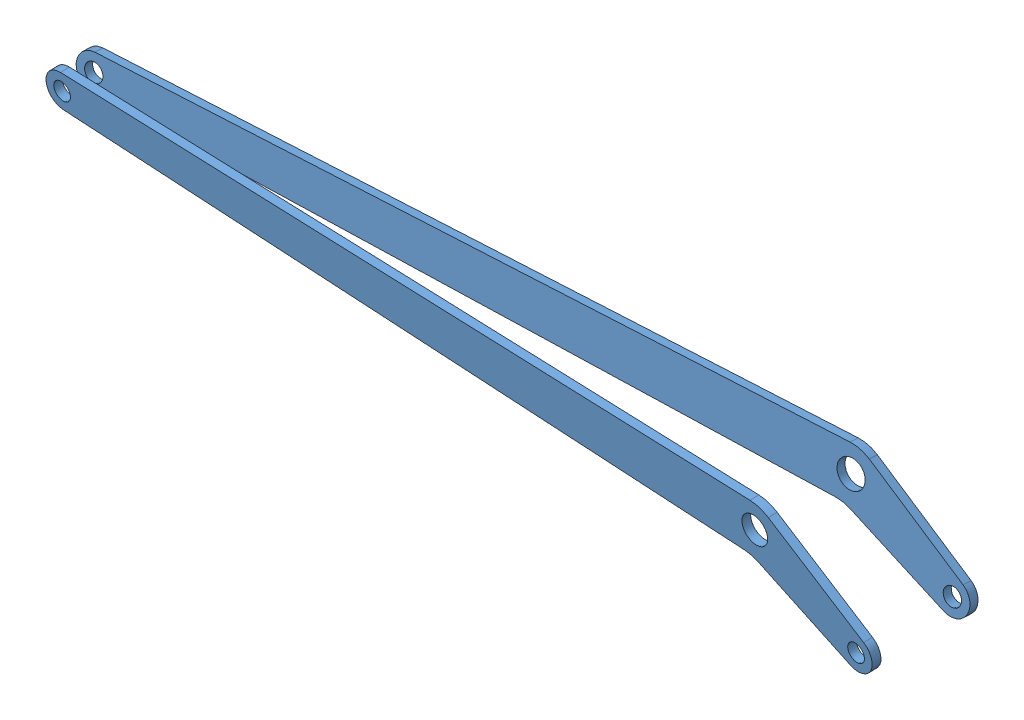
SolidWorks assembly Bras K équipé.SLDASM, configuration Default (file format 9000). Lengths in mm.
Overall size (254.91 29.56 35.24).
2 component instances, 1 part files, 4 mates.
Components (placement in the parent):
- Bras K-2: Bras K.SLDPRT [Default] at (-214.7863 0.3885 3.3892) x (-0.999006 0.001807 -0.044534) z (-0.044534 -0.080971 0.995721) size (255 28.99 2.5)
- Bras K-3: Bras K.SLDPRT [Default] at (-214.8977 0.186 -5.8785) x (-0.999006 0.001807 0.044534) z (0.044534 0.080971 0.995721) size (255 28.99 2.5)
Mates (geometry in assembly coordinates):
- Coïncidente8: coincident: point of Bras K-2; line of assembly
- Tangent4: tangent: plane of Bras K-2 through (-214.7863 0.3885 3.3892) normal (0.044534 0.080971 -0.995721); circle of assembly
- Coïncidente14: coincident: point of Bras K-2; line of assembly
- Tangent8: tangent: plane of Bras K-2 through (-214.7863 0.3885 3.3892) normal (0.044534 0.080971 -0.995721); circle of assembly
